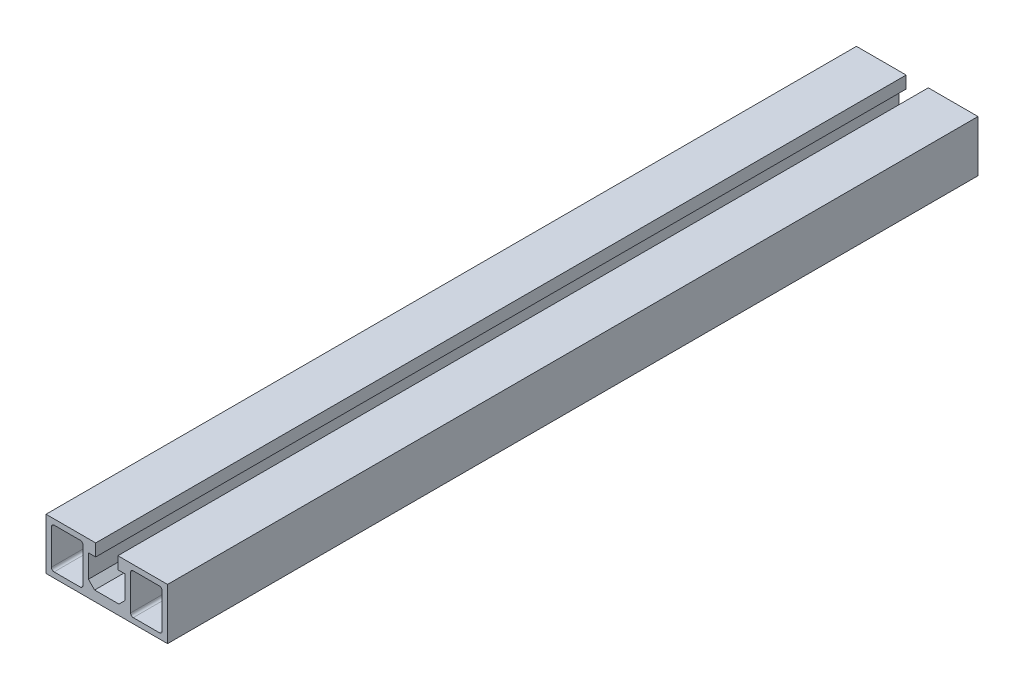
from build123d import *

# Parameters (mm, degrees)
EXTRUDE1_DEPTH      = 150
EXTRUDE1_DEPTH_BACK = 150


with BuildPart() as part:
    # Sketch1 → Extrude1 (new, two sides: drawn at the far end of the back side and taken through both)
    with BuildSketch(Plane.XY.offset(-EXTRUDE1_DEPTH_BACK)):
        Polygon((-22.5, 9.5), (-22.5, -9.5), (22.5, -9.5), (22.5, 9.5), (4.1, 9.5), (4.1, 5), (6.8, 5), (6.8, -3.5), (4.5, -5.8), (-4.5, -5.8), (-6.8, -3.5), (-6.8, 5), (-4.1, 5), (-4.1, 9.5), align=None)
        with BuildLine():
            Line((19.5, -7.5), (9.8, -7.5))
            ThreePointArc((9.8, -7.5), (9.092893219, -7.207106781), (8.8, -6.5))
            Line((8.8, -6.5), (8.8, 6.5))
            ThreePointArc((8.8, 6.5), (9.092893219, 7.207106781), (9.8, 7.5))
            Line((9.8, 7.5), (19.5, 7.5))
            ThreePointArc((19.5, 7.5), (20.207106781, 7.207106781), (20.5, 6.5))
            Line((20.5, 6.5), (20.5, -6.5))
            ThreePointArc((20.5, -6.5), (20.207106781, -7.207106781), (19.5, -7.5))
        make_face(mode=Mode.SUBTRACT)
        with BuildLine():
            Line((-8.8, 6.5), (-8.8, -6.5))
            ThreePointArc((-8.8, -6.5), (-9.092893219, -7.207106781), (-9.8, -7.5))
            Line((-9.8, -7.5), (-19.5, -7.5))
            ThreePointArc((-19.5, -7.5), (-20.207106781, -7.207106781), (-20.5, -6.5))
            Line((-20.5, -6.5), (-20.5, 6.5))
            ThreePointArc((-20.5, 6.5), (-20.207106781, 7.207106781), (-19.5, 7.5))
            Line((-19.5, 7.5), (-9.8, 7.5))
            ThreePointArc((-9.8, 7.5), (-9.092893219, 7.207106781), (-8.8, 6.5))
        make_face(mode=Mode.SUBTRACT)
    extrude(amount=EXTRUDE1_DEPTH + EXTRUDE1_DEPTH_BACK)


solid = part.part
